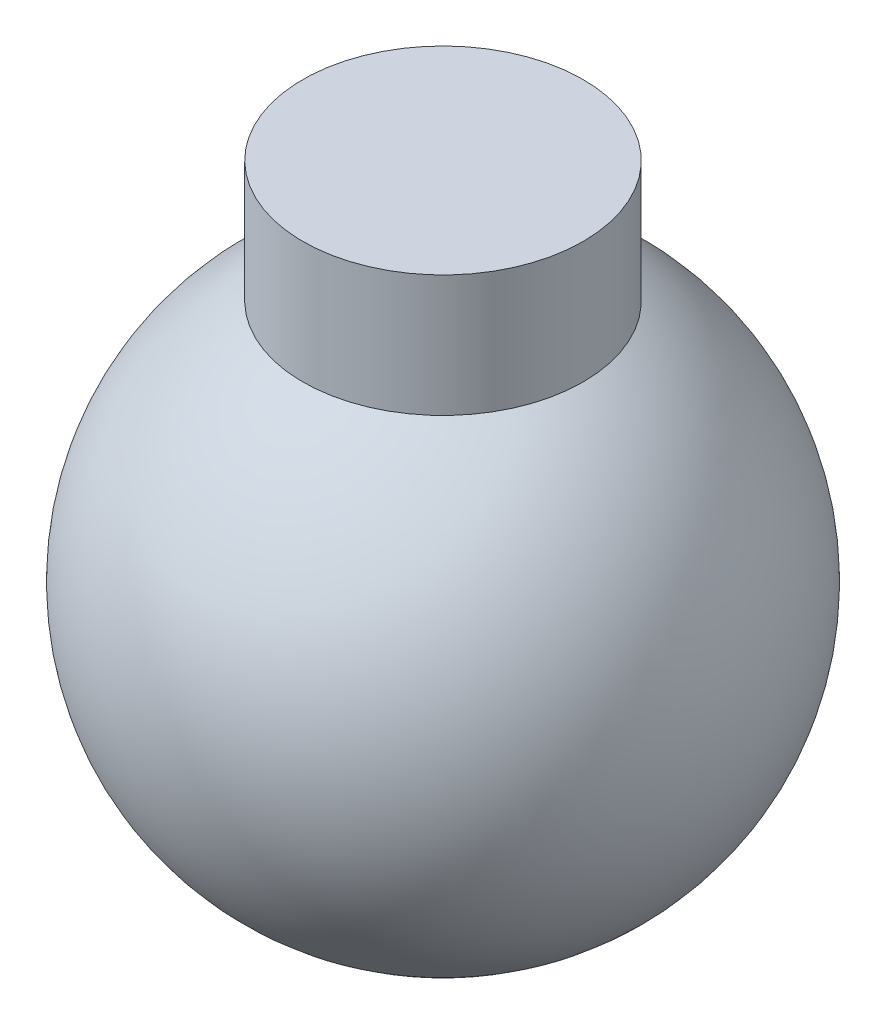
ISO-10303-21;
HEADER;
FILE_DESCRIPTION(('STEP AP214'),'2;1');
FILE_NAME('part.step','',(''),(''),'','','');
FILE_SCHEMA(('AUTOMOTIVE_DESIGN { 1 0 10303 214 1 1 1 1 }'));
ENDSEC;
DATA;
#1=APPLICATION_CONTEXT('core data for automotive mechanical design processes');
#2=APPLICATION_PROTOCOL_DEFINITION('international standard','automotive_design',2000,#1);
#3=PRODUCT_CONTEXT('',#1,'mechanical');
#4=PRODUCT('Part','Part','',(#3));
#5=PRODUCT_RELATED_PRODUCT_CATEGORY('part','',(#4));
#6=PRODUCT_DEFINITION_FORMATION('','',#4);
#7=PRODUCT_DEFINITION_CONTEXT('part definition',#1,'design');
#8=PRODUCT_DEFINITION('design','',#6,#7);
#9=PRODUCT_DEFINITION_SHAPE('','',#8);
#10=(LENGTH_UNIT() NAMED_UNIT(*) SI_UNIT(.MILLI.,.METRE.));
#11=(NAMED_UNIT(*) PLANE_ANGLE_UNIT() SI_UNIT($,.RADIAN.));
#12=(NAMED_UNIT(*) SI_UNIT($,.STERADIAN.) SOLID_ANGLE_UNIT());
#13=UNCERTAINTY_MEASURE_WITH_UNIT(LENGTH_MEASURE(1.E-05),#10,'distance_accuracy_value','');
#14=(GEOMETRIC_REPRESENTATION_CONTEXT(3) GLOBAL_UNCERTAINTY_ASSIGNED_CONTEXT((#13)) GLOBAL_UNIT_ASSIGNED_CONTEXT((#10,
#11,#12)) REPRESENTATION_CONTEXT('',''));
#15=CARTESIAN_POINT('',(0.,0.,0.));
#16=DIRECTION('',(0.,0.,1.));
#17=DIRECTION('',(1.,0.,0.));
#18=AXIS2_PLACEMENT_3D('',#15,#16,#17);
#19=CARTESIAN_POINT('',(2.5,6.50000000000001,0.));
#20=DIRECTION('',(0.,1.,0.));
#21=DIRECTION('',(-1.,0.,0.));
#22=AXIS2_PLACEMENT_3D('',#19,#20,#21);
#23=PLANE('',#22);
#24=CARTESIAN_POINT('',(0.,6.49999999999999,0.));
#25=DIRECTION('',(0.,-1.,0.));
#26=DIRECTION('',(1.,0.,0.));
#27=AXIS2_PLACEMENT_3D('',#24,#25,#26);
#28=CIRCLE('',#27,2.5);
#29=CARTESIAN_POINT('',(2.5,6.5,0.));
#30=VERTEX_POINT('',#29);
#31=EDGE_CURVE('E37',#30,#30,#28,.T.);
#32=ORIENTED_EDGE('',*,*,#31,.F.);
#33=EDGE_LOOP('',(#32));
#34=FACE_BOUND('',#33,.T.);
#35=ADVANCED_FACE('F31',(#34),#23,.T.);
#36=CARTESIAN_POINT('',(0.,0.,0.));
#37=DIRECTION('',(0.,-1.,0.));
#38=DIRECTION('',(1.,0.,0.));
#39=AXIS2_PLACEMENT_3D('',#36,#37,#38);
#40=SPHERICAL_SURFACE('',#39,5.);
#41=CARTESIAN_POINT('',(0.,4.33012701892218,0.));
#42=DIRECTION('',(0.,-1.,0.));
#43=DIRECTION('',(1.,0.,0.));
#44=AXIS2_PLACEMENT_3D('',#41,#42,#43);
#45=CIRCLE('',#44,2.49999999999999);
#46=CARTESIAN_POINT('',(2.5,4.33012701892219,0.));
#47=VERTEX_POINT('',#46);
#48=EDGE_CURVE('E10',#47,#47,#45,.T.);
#49=ORIENTED_EDGE('',*,*,#48,.T.);
#50=EDGE_LOOP('',(#49));
#51=FACE_BOUND('',#50,.T.);
#52=ADVANCED_FACE('F47',(#51),#40,.T.);
#53=CARTESIAN_POINT('',(0.,-5.,0.));
#54=DIRECTION('',(0.,-1.,0.));
#55=DIRECTION('',(1.,0.,0.));
#56=AXIS2_PLACEMENT_3D('',#53,#54,#55);
#57=CYLINDRICAL_SURFACE('',#56,2.5);
#58=ORIENTED_EDGE('',*,*,#31,.T.);
#59=EDGE_LOOP('',(#58));
#60=FACE_BOUND('',#59,.T.);
#61=ORIENTED_EDGE('',*,*,#48,.F.);
#62=EDGE_LOOP('',(#61));
#63=FACE_BOUND('',#62,.T.);
#64=ADVANCED_FACE('F43',(#60,#63),#57,.T.);
#65=CLOSED_SHELL('',(#35,#52,#64));
#66=MANIFOLD_SOLID_BREP('B2',#65);
#67=ADVANCED_BREP_SHAPE_REPRESENTATION('',(#18,#66),#14);
#68=SHAPE_DEFINITION_REPRESENTATION(#9,#67);
ENDSEC;
END-ISO-10303-21;
